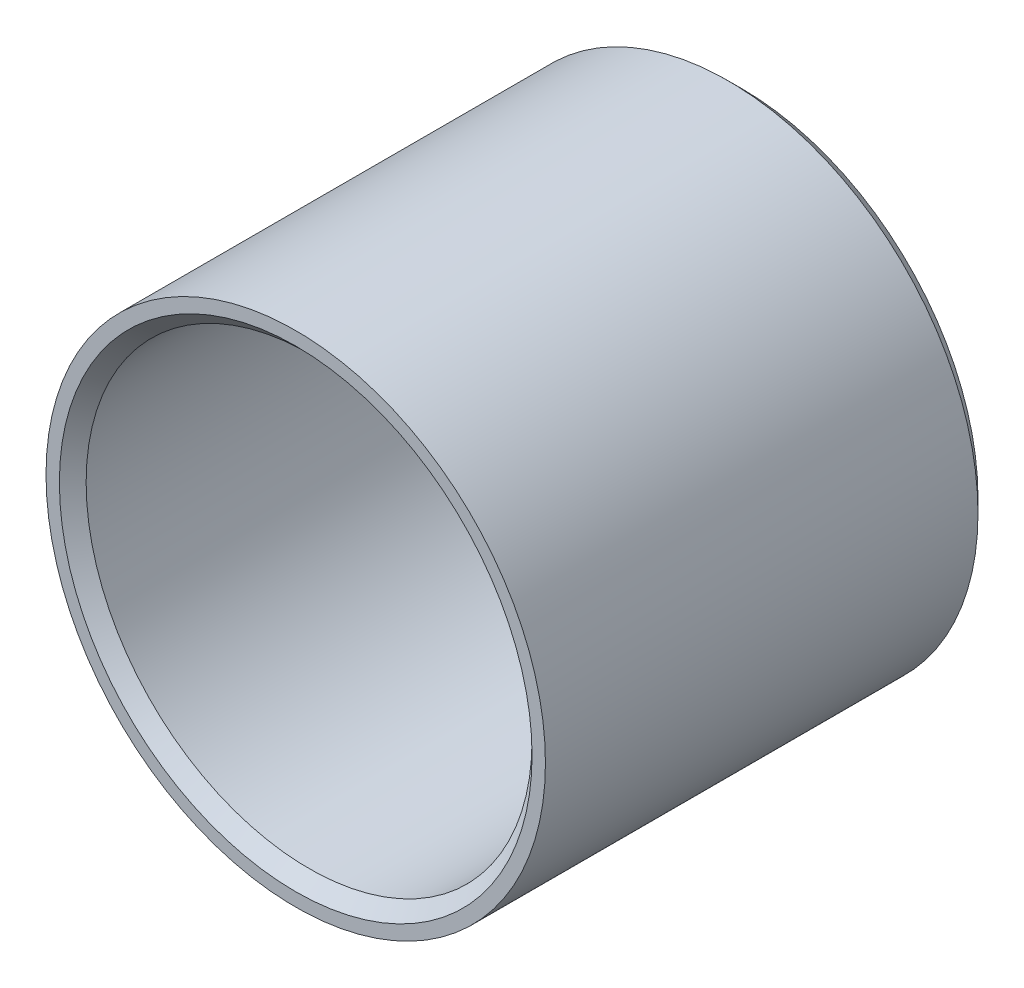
ISO-10303-21;
HEADER;
FILE_DESCRIPTION(('STEP AP214'),'2;1');
FILE_NAME('part.step','',(''),(''),'','','');
FILE_SCHEMA(('AUTOMOTIVE_DESIGN { 1 0 10303 214 1 1 1 1 }'));
ENDSEC;
DATA;
#1=APPLICATION_CONTEXT('core data for automotive mechanical design processes');
#2=APPLICATION_PROTOCOL_DEFINITION('international standard','automotive_design',2000,#1);
#3=PRODUCT_CONTEXT('',#1,'mechanical');
#4=PRODUCT('Part','Part','',(#3));
#5=PRODUCT_RELATED_PRODUCT_CATEGORY('part','',(#4));
#6=PRODUCT_DEFINITION_FORMATION('','',#4);
#7=PRODUCT_DEFINITION_CONTEXT('part definition',#1,'design');
#8=PRODUCT_DEFINITION('design','',#6,#7);
#9=PRODUCT_DEFINITION_SHAPE('','',#8);
#10=(LENGTH_UNIT() NAMED_UNIT(*) SI_UNIT(.MILLI.,.METRE.));
#11=(NAMED_UNIT(*) PLANE_ANGLE_UNIT() SI_UNIT($,.RADIAN.));
#12=(NAMED_UNIT(*) SI_UNIT($,.STERADIAN.) SOLID_ANGLE_UNIT());
#13=UNCERTAINTY_MEASURE_WITH_UNIT(LENGTH_MEASURE(1.E-05),#10,'distance_accuracy_value','');
#14=(GEOMETRIC_REPRESENTATION_CONTEXT(3) GLOBAL_UNCERTAINTY_ASSIGNED_CONTEXT((#13)) GLOBAL_UNIT_ASSIGNED_CONTEXT((#10,
#11,#12)) REPRESENTATION_CONTEXT('',''));
#15=CARTESIAN_POINT('',(0.,0.,0.));
#16=DIRECTION('',(0.,0.,1.));
#17=DIRECTION('',(1.,0.,0.));
#18=AXIS2_PLACEMENT_3D('',#15,#16,#17);
#19=CARTESIAN_POINT('',(0.,0.,12.5));
#20=DIRECTION('',(0.,0.,1.));
#21=DIRECTION('',(1.,0.,0.));
#22=AXIS2_PLACEMENT_3D('',#19,#20,#21);
#23=PLANE('',#22);
#24=CARTESIAN_POINT('',(0.,0.,12.5));
#25=DIRECTION('',(0.,0.,1.));
#26=DIRECTION('',(1.,0.,0.));
#27=AXIS2_PLACEMENT_3D('',#24,#25,#26);
#28=CIRCLE('',#27,13.25);
#29=CARTESIAN_POINT('',(13.25,0.,12.5));
#30=VERTEX_POINT('',#29);
#31=EDGE_CURVE('E41',#30,#30,#28,.F.);
#32=ORIENTED_EDGE('',*,*,#31,.T.);
#33=EDGE_LOOP('',(#32));
#34=FACE_BOUND('',#33,.T.);
#35=CARTESIAN_POINT('',(0.,0.,12.5));
#36=DIRECTION('',(0.,0.,1.));
#37=DIRECTION('',(1.,0.,0.));
#38=AXIS2_PLACEMENT_3D('',#35,#36,#37);
#39=CIRCLE('',#38,14.);
#40=CARTESIAN_POINT('',(14.,0.,12.5));
#41=VERTEX_POINT('',#40);
#42=EDGE_CURVE('E50',#41,#41,#39,.T.);
#43=ORIENTED_EDGE('',*,*,#42,.T.);
#44=EDGE_LOOP('',(#43));
#45=FACE_BOUND('',#44,.T.);
#46=ADVANCED_FACE('F30',(#34,#45),#23,.T.);
#47=CARTESIAN_POINT('',(0.,0.,12.5));
#48=DIRECTION('',(0.,0.,-1.));
#49=DIRECTION('',(-1.,0.,0.));
#50=AXIS2_PLACEMENT_3D('',#47,#48,#49);
#51=CYLINDRICAL_SURFACE('',#50,14.);
#52=CARTESIAN_POINT('',(0.,0.,-11.75));
#53=DIRECTION('',(0.,0.,1.));
#54=DIRECTION('',(1.,0.,0.));
#55=AXIS2_PLACEMENT_3D('',#52,#53,#54);
#56=CIRCLE('',#55,14.);
#57=CARTESIAN_POINT('',(14.,0.,-11.75));
#58=VERTEX_POINT('',#57);
#59=EDGE_CURVE('E37',#58,#58,#56,.T.);
#60=ORIENTED_EDGE('',*,*,#59,.T.);
#61=EDGE_LOOP('',(#60));
#62=FACE_BOUND('',#61,.T.);
#63=ORIENTED_EDGE('',*,*,#42,.F.);
#64=EDGE_LOOP('',(#63));
#65=FACE_BOUND('',#64,.T.);
#66=ADVANCED_FACE('F32',(#62,#65),#51,.T.);
#67=CARTESIAN_POINT('',(0.,0.,12.5));
#68=DIRECTION('',(0.,0.,-1.));
#69=DIRECTION('',(-1.,0.,0.));
#70=AXIS2_PLACEMENT_3D('',#67,#68,#69);
#71=CYLINDRICAL_SURFACE('',#70,12.5);
#72=CARTESIAN_POINT('',(0.,0.,11.75));
#73=DIRECTION('',(0.,0.,1.));
#74=DIRECTION('',(1.,0.,0.));
#75=AXIS2_PLACEMENT_3D('',#72,#73,#74);
#76=CIRCLE('',#75,12.5);
#77=CARTESIAN_POINT('',(12.5,0.,11.75));
#78=VERTEX_POINT('',#77);
#79=EDGE_CURVE('E45',#78,#78,#76,.T.);
#80=ORIENTED_EDGE('',*,*,#79,.T.);
#81=EDGE_LOOP('',(#80));
#82=FACE_BOUND('',#81,.T.);
#83=CARTESIAN_POINT('',(0.,0.,-12.5));
#84=DIRECTION('',(0.,0.,1.));
#85=DIRECTION('',(1.,0.,0.));
#86=AXIS2_PLACEMENT_3D('',#83,#84,#85);
#87=CIRCLE('',#86,12.5);
#88=CARTESIAN_POINT('',(12.5,0.,-12.5));
#89=VERTEX_POINT('',#88);
#90=EDGE_CURVE('E53',#89,#89,#87,.T.);
#91=ORIENTED_EDGE('',*,*,#90,.F.);
#92=EDGE_LOOP('',(#91));
#93=FACE_BOUND('',#92,.T.);
#94=ADVANCED_FACE('F59',(#82,#93),#71,.F.);
#95=CARTESIAN_POINT('',(0.,0.,-12.5));
#96=DIRECTION('',(0.,0.,1.));
#97=DIRECTION('',(1.,0.,0.));
#98=AXIS2_PLACEMENT_3D('',#95,#96,#97);
#99=PLANE('',#98);
#100=CARTESIAN_POINT('',(0.,0.,-12.5));
#101=DIRECTION('',(0.,0.,1.));
#102=DIRECTION('',(1.,0.,0.));
#103=AXIS2_PLACEMENT_3D('',#100,#101,#102);
#104=CIRCLE('',#103,13.25);
#105=CARTESIAN_POINT('',(13.25,0.,-12.5));
#106=VERTEX_POINT('',#105);
#107=EDGE_CURVE('E10',#106,#106,#104,.F.);
#108=ORIENTED_EDGE('',*,*,#107,.T.);
#109=EDGE_LOOP('',(#108));
#110=FACE_BOUND('',#109,.T.);
#111=ORIENTED_EDGE('',*,*,#90,.T.);
#112=EDGE_LOOP('',(#111));
#113=FACE_BOUND('',#112,.T.);
#114=ADVANCED_FACE('F57',(#110,#113),#99,.F.);
#115=CARTESIAN_POINT('',(0.,0.,11.75));
#116=DIRECTION('',(0.,0.,1.));
#117=DIRECTION('',(1.,0.,0.));
#118=AXIS2_PLACEMENT_3D('',#115,#116,#117);
#119=CONICAL_SURFACE('',#118,12.5,0.785398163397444);
#120=ORIENTED_EDGE('',*,*,#31,.F.);
#121=EDGE_LOOP('',(#120));
#122=FACE_BOUND('',#121,.T.);
#123=ORIENTED_EDGE('',*,*,#79,.F.);
#124=EDGE_LOOP('',(#123));
#125=FACE_BOUND('',#124,.T.);
#126=ADVANCED_FACE('F67',(#122,#125),#119,.F.);
#127=CARTESIAN_POINT('',(0.,0.,-11.75));
#128=DIRECTION('',(0.,0.,1.));
#129=DIRECTION('',(1.,0.,0.));
#130=AXIS2_PLACEMENT_3D('',#127,#128,#129);
#131=CONICAL_SURFACE('',#130,14.,0.785398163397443);
#132=ORIENTED_EDGE('',*,*,#107,.F.);
#133=EDGE_LOOP('',(#132));
#134=FACE_BOUND('',#133,.T.);
#135=ORIENTED_EDGE('',*,*,#59,.F.);
#136=EDGE_LOOP('',(#135));
#137=FACE_BOUND('',#136,.T.);
#138=ADVANCED_FACE('F80',(#134,#137),#131,.T.);
#139=CLOSED_SHELL('',(#46,#66,#94,#114,#126,#138));
#140=MANIFOLD_SOLID_BREP('B2',#139);
#141=ADVANCED_BREP_SHAPE_REPRESENTATION('',(#18,#140),#14);
#142=SHAPE_DEFINITION_REPRESENTATION(#9,#141);
ENDSEC;
END-ISO-10303-21;
